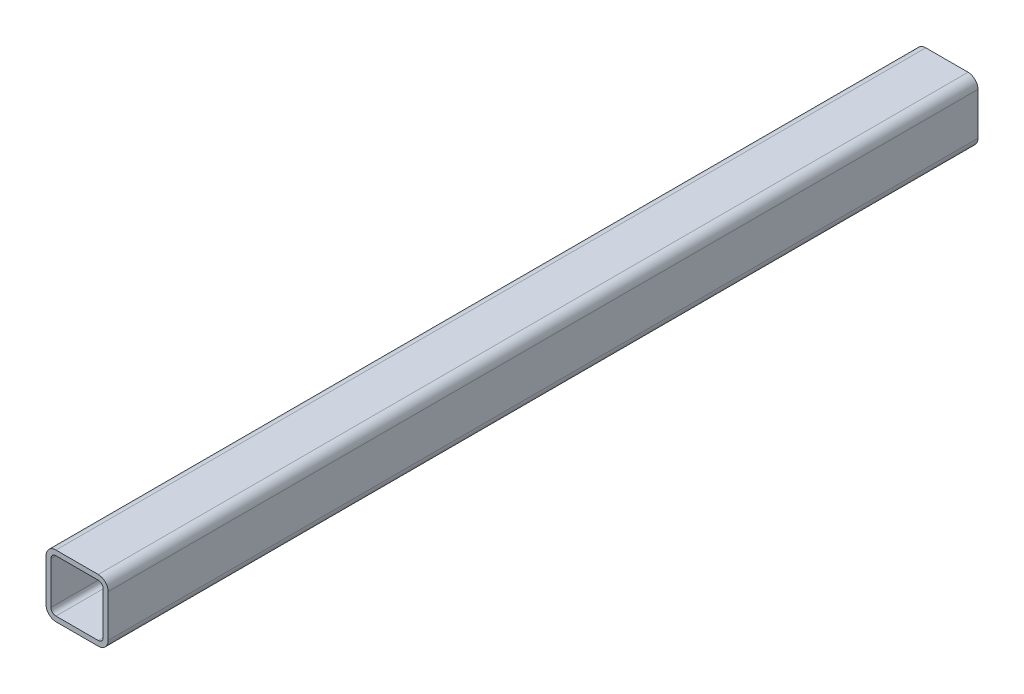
from build123d import *

# Parameters (mm, degrees)
EXTRUDE_THIN1_DEPTH = 266.7


with BuildPart() as part:
    # Sketch1 → Extrude-Thin1 (new, symmetric)
    with BuildSketch(Plane.XY):
        with BuildLine():
            Line((-19.05, -12.97432), (-19.05, 12.97432))
            ThreePointArc((-19.05, 12.97432), (-17.270474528, 17.270474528), (-12.97432, 19.05))
            Line((-12.97432, 19.05), (12.97432, 19.05))
            ThreePointArc((12.97432, 19.05), (17.270474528, 17.270474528), (19.05, 12.97432))
            Line((19.05, 12.97432), (19.05, -12.97432))
            ThreePointArc((19.05, -12.97432), (17.270474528, -17.270474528), (12.97432, -19.05))
            Line((12.97432, -19.05), (-12.97432, -19.05))
            ThreePointArc((-12.97432, -19.05), (-17.270474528, -17.270474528), (-19.05, -12.97432))
        make_face()
        with BuildLine():
            Line((-16.01216, -12.97432), (-16.01216, 12.97432))
            ThreePointArc((-16.01216, 12.97432), (-15.122397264, 15.122397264), (-12.97432, 16.01216))
            Line((-12.97432, 16.01216), (12.97432, 16.01216))
            ThreePointArc((12.97432, 16.01216), (15.122397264, 15.122397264), (16.01216, 12.97432))
            Line((16.01216, 12.97432), (16.01216, -12.97432))
            ThreePointArc((16.01216, -12.97432), (15.122397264, -15.122397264), (12.97432, -16.01216))
            Line((12.97432, -16.01216), (-12.97432, -16.01216))
            ThreePointArc((-12.97432, -16.01216), (-15.122397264, -15.122397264), (-16.01216, -12.97432))
        make_face(mode=Mode.SUBTRACT)
    extrude(amount=EXTRUDE_THIN1_DEPTH, both=True)


solid = part.part
